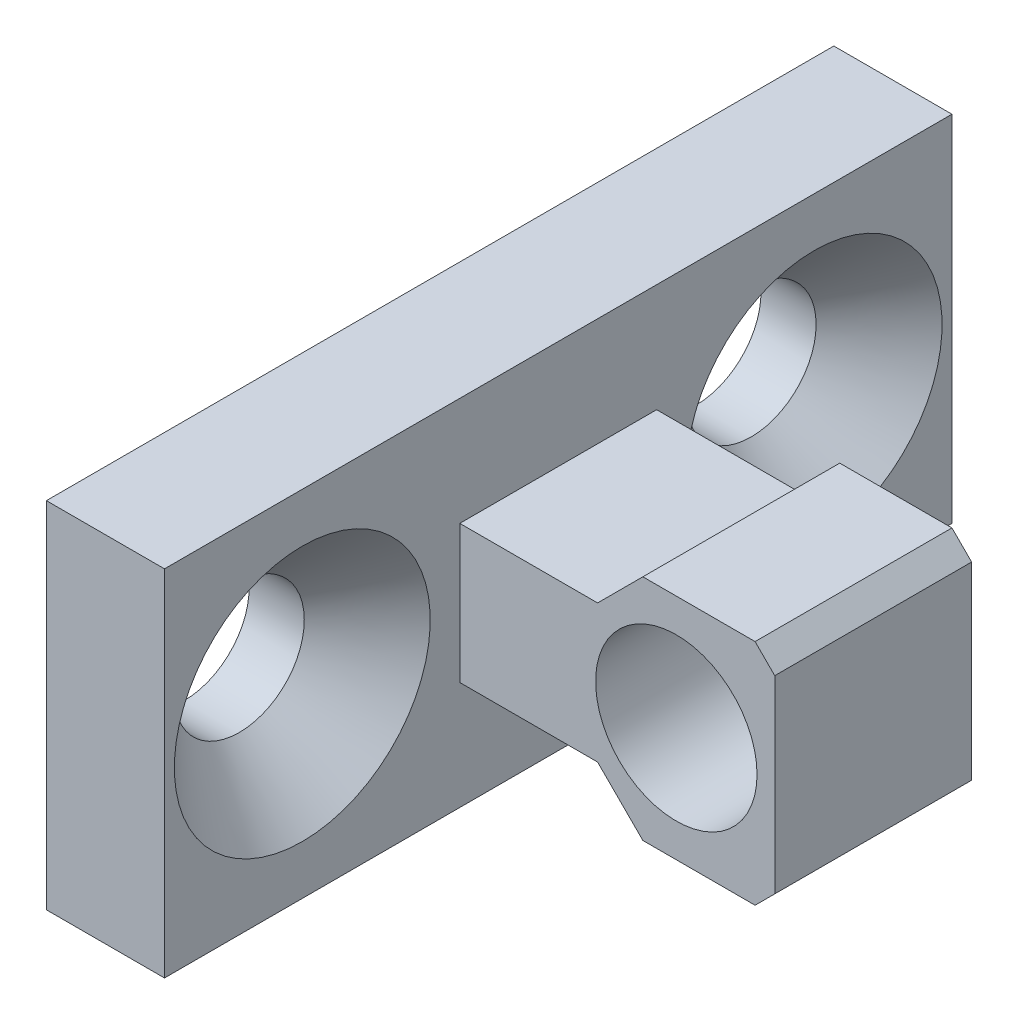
ISO-10303-21;
HEADER;
FILE_DESCRIPTION(('STEP AP214'),'2;1');
FILE_NAME('part.step','',(''),(''),'','','');
FILE_SCHEMA(('AUTOMOTIVE_DESIGN { 1 0 10303 214 1 1 1 1 }'));
ENDSEC;
DATA;
#1=APPLICATION_CONTEXT('core data for automotive mechanical design processes');
#2=APPLICATION_PROTOCOL_DEFINITION('international standard','automotive_design',2000,#1);
#3=PRODUCT_CONTEXT('',#1,'mechanical');
#4=PRODUCT('Part','Part','',(#3));
#5=PRODUCT_RELATED_PRODUCT_CATEGORY('part','',(#4));
#6=PRODUCT_DEFINITION_FORMATION('','',#4);
#7=PRODUCT_DEFINITION_CONTEXT('part definition',#1,'design');
#8=PRODUCT_DEFINITION('design','',#6,#7);
#9=PRODUCT_DEFINITION_SHAPE('','',#8);
#10=(LENGTH_UNIT() NAMED_UNIT(*) SI_UNIT(.MILLI.,.METRE.));
#11=(NAMED_UNIT(*) PLANE_ANGLE_UNIT() SI_UNIT($,.RADIAN.));
#12=(NAMED_UNIT(*) SI_UNIT($,.STERADIAN.) SOLID_ANGLE_UNIT());
#13=UNCERTAINTY_MEASURE_WITH_UNIT(LENGTH_MEASURE(1.E-05),#10,'distance_accuracy_value','');
#14=(GEOMETRIC_REPRESENTATION_CONTEXT(3) GLOBAL_UNCERTAINTY_ASSIGNED_CONTEXT((#13)) GLOBAL_UNIT_ASSIGNED_CONTEXT((#10,
#11,#12)) REPRESENTATION_CONTEXT('',''));
#15=CARTESIAN_POINT('',(0.,0.,0.));
#16=DIRECTION('',(0.,0.,1.));
#17=DIRECTION('',(1.,0.,0.));
#18=AXIS2_PLACEMENT_3D('',#15,#16,#17);
#19=CARTESIAN_POINT('',(22.,4.80000000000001,5.));
#20=DIRECTION('',(0.707106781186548,0.707106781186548,0.));
#21=DIRECTION('',(-0.707106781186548,0.707106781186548,0.));
#22=AXIS2_PLACEMENT_3D('',#19,#20,#21);
#23=PLANE('',#22);
#24=DIRECTION('',(-0.707106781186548,0.707106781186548,0.));
#25=VECTOR('',#24,1.);
#26=CARTESIAN_POINT('',(22.,4.80000000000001,5.));
#27=LINE('',#26,#25);
#28=CARTESIAN_POINT('',(21.,5.80000000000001,5.));
#29=VERTEX_POINT('',#28);
#30=CARTESIAN_POINT('',(22.,4.80000000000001,5.));
#31=VERTEX_POINT('',#30);
#32=EDGE_CURVE('E114',#29,#31,#27,.F.);
#33=ORIENTED_EDGE('',*,*,#32,.T.);
#34=DIRECTION('',(0.,0.,-1.));
#35=VECTOR('',#34,1.);
#36=CARTESIAN_POINT('',(22.,4.80000000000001,5.));
#37=LINE('',#36,#35);
#38=CARTESIAN_POINT('',(22.,4.80000000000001,-5.));
#39=VERTEX_POINT('',#38);
#40=EDGE_CURVE('E155',#39,#31,#37,.F.);
#41=ORIENTED_EDGE('',*,*,#40,.F.);
#42=DIRECTION('',(-0.707106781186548,0.707106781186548,0.));
#43=VECTOR('',#42,1.);
#44=CARTESIAN_POINT('',(22.,4.80000000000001,-5.));
#45=LINE('',#44,#43);
#46=CARTESIAN_POINT('',(21.,5.80000000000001,-5.));
#47=VERTEX_POINT('',#46);
#48=EDGE_CURVE('E165',#39,#47,#45,.T.);
#49=ORIENTED_EDGE('',*,*,#48,.T.);
#50=DIRECTION('',(0.,0.,1.));
#51=VECTOR('',#50,1.);
#52=CARTESIAN_POINT('',(21.,5.80000000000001,5.));
#53=LINE('',#52,#51);
#54=EDGE_CURVE('E158',#29,#47,#53,.F.);
#55=ORIENTED_EDGE('',*,*,#54,.F.);
#56=EDGE_LOOP('',(#33,#41,#49,#55));
#57=FACE_BOUND('',#56,.T.);
#58=ADVANCED_FACE('F15',(#57),#23,.T.);
#59=CARTESIAN_POINT('',(21.,-5.80000000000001,5.));
#60=DIRECTION('',(0.707106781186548,-0.707106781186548,0.));
#61=DIRECTION('',(0.707106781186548,0.707106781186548,0.));
#62=AXIS2_PLACEMENT_3D('',#59,#60,#61);
#63=PLANE('',#62);
#64=DIRECTION('',(0.707106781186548,0.707106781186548,0.));
#65=VECTOR('',#64,1.);
#66=CARTESIAN_POINT('',(21.,-5.80000000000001,5.));
#67=LINE('',#66,#65);
#68=CARTESIAN_POINT('',(22.,-4.80000000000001,5.));
#69=VERTEX_POINT('',#68);
#70=CARTESIAN_POINT('',(21.,-5.80000000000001,5.));
#71=VERTEX_POINT('',#70);
#72=EDGE_CURVE('E160',#69,#71,#67,.F.);
#73=ORIENTED_EDGE('',*,*,#72,.T.);
#74=DIRECTION('',(0.,0.,-1.));
#75=VECTOR('',#74,1.);
#76=CARTESIAN_POINT('',(21.,-5.80000000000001,5.));
#77=LINE('',#76,#75);
#78=CARTESIAN_POINT('',(21.,-5.80000000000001,-5.));
#79=VERTEX_POINT('',#78);
#80=EDGE_CURVE('E149',#79,#71,#77,.F.);
#81=ORIENTED_EDGE('',*,*,#80,.F.);
#82=DIRECTION('',(0.707106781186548,0.707106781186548,0.));
#83=VECTOR('',#82,1.);
#84=CARTESIAN_POINT('',(21.,-5.80000000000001,-5.));
#85=LINE('',#84,#83);
#86=CARTESIAN_POINT('',(22.,-4.80000000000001,-5.));
#87=VERTEX_POINT('',#86);
#88=EDGE_CURVE('E162',#79,#87,#85,.T.);
#89=ORIENTED_EDGE('',*,*,#88,.T.);
#90=DIRECTION('',(0.,0.,-1.));
#91=VECTOR('',#90,1.);
#92=CARTESIAN_POINT('',(22.,-4.80000000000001,5.));
#93=LINE('',#92,#91);
#94=EDGE_CURVE('E152',#69,#87,#93,.T.);
#95=ORIENTED_EDGE('',*,*,#94,.F.);
#96=EDGE_LOOP('',(#73,#81,#89,#95));
#97=FACE_BOUND('',#96,.T.);
#98=ADVANCED_FACE('F250',(#97),#63,.T.);
#99=CARTESIAN_POINT('',(21.,5.80000000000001,5.));
#100=DIRECTION('',(0.,1.,0.));
#101=DIRECTION('',(0.,0.,1.));
#102=AXIS2_PLACEMENT_3D('',#99,#100,#101);
#103=PLANE('',#102);
#104=DIRECTION('',(-1.,0.,0.));
#105=VECTOR('',#104,1.);
#106=CARTESIAN_POINT('',(14.5317939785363,5.80000000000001,5.));
#107=LINE('',#106,#105);
#108=CARTESIAN_POINT('',(15.3,5.80000000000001,5.));
#109=VERTEX_POINT('',#108);
#110=EDGE_CURVE('E124',#109,#29,#107,.F.);
#111=ORIENTED_EDGE('',*,*,#110,.T.);
#112=ORIENTED_EDGE('',*,*,#54,.T.);
#113=DIRECTION('',(-1.,0.,0.));
#114=VECTOR('',#113,1.);
#115=CARTESIAN_POINT('',(14.5317939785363,5.80000000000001,-5.));
#116=LINE('',#115,#114);
#117=CARTESIAN_POINT('',(15.3,5.80000000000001,-5.));
#118=VERTEX_POINT('',#117);
#119=EDGE_CURVE('E126',#118,#47,#116,.F.);
#120=ORIENTED_EDGE('',*,*,#119,.F.);
#121=DIRECTION('',(0.,0.,1.));
#122=VECTOR('',#121,1.);
#123=CARTESIAN_POINT('',(15.3,5.80000000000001,5.));
#124=LINE('',#123,#122);
#125=EDGE_CURVE('E120',#109,#118,#124,.F.);
#126=ORIENTED_EDGE('',*,*,#125,.F.);
#127=EDGE_LOOP('',(#111,#112,#120,#126));
#128=FACE_BOUND('',#127,.T.);
#129=ADVANCED_FACE('F122',(#128),#103,.T.);
#130=CARTESIAN_POINT('',(22.,-4.80000000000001,5.));
#131=DIRECTION('',(1.,0.,0.));
#132=DIRECTION('',(0.,0.,-1.));
#133=AXIS2_PLACEMENT_3D('',#130,#131,#132);
#134=PLANE('',#133);
#135=DIRECTION('',(0.,1.,0.));
#136=VECTOR('',#135,1.);
#137=CARTESIAN_POINT('',(22.,0.,5.));
#138=LINE('',#137,#136);
#139=EDGE_CURVE('E140',#31,#69,#138,.F.);
#140=ORIENTED_EDGE('',*,*,#139,.T.);
#141=ORIENTED_EDGE('',*,*,#94,.T.);
#142=DIRECTION('',(0.,1.,0.));
#143=VECTOR('',#142,1.);
#144=CARTESIAN_POINT('',(22.,0.,-5.));
#145=LINE('',#144,#143);
#146=EDGE_CURVE('E193',#39,#87,#145,.F.);
#147=ORIENTED_EDGE('',*,*,#146,.F.);
#148=ORIENTED_EDGE('',*,*,#40,.T.);
#149=EDGE_LOOP('',(#140,#141,#147,#148));
#150=FACE_BOUND('',#149,.T.);
#151=ADVANCED_FACE('F247',(#150),#134,.T.);
#152=CARTESIAN_POINT('',(15.3,-5.80000000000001,5.));
#153=DIRECTION('',(0.,-1.,0.));
#154=DIRECTION('',(0.,0.,-1.));
#155=AXIS2_PLACEMENT_3D('',#152,#153,#154);
#156=PLANE('',#155);
#157=DIRECTION('',(-1.,0.,0.));
#158=VECTOR('',#157,1.);
#159=CARTESIAN_POINT('',(14.5317939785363,-5.80000000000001,5.));
#160=LINE('',#159,#158);
#161=CARTESIAN_POINT('',(15.3,-5.80000000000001,5.));
#162=VERTEX_POINT('',#161);
#163=EDGE_CURVE('E143',#71,#162,#160,.T.);
#164=ORIENTED_EDGE('',*,*,#163,.T.);
#165=DIRECTION('',(0.,0.,1.));
#166=VECTOR('',#165,1.);
#167=CARTESIAN_POINT('',(15.3,-5.8,5.));
#168=LINE('',#167,#166);
#169=CARTESIAN_POINT('',(15.3,-5.80000000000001,-5.));
#170=VERTEX_POINT('',#169);
#171=EDGE_CURVE('E130',#170,#162,#168,.T.);
#172=ORIENTED_EDGE('',*,*,#171,.F.);
#173=DIRECTION('',(-1.,0.,0.));
#174=VECTOR('',#173,1.);
#175=CARTESIAN_POINT('',(14.5317939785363,-5.80000000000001,-5.));
#176=LINE('',#175,#174);
#177=EDGE_CURVE('E187',#79,#170,#176,.T.);
#178=ORIENTED_EDGE('',*,*,#177,.F.);
#179=ORIENTED_EDGE('',*,*,#80,.T.);
#180=EDGE_LOOP('',(#164,#172,#178,#179));
#181=FACE_BOUND('',#180,.T.);
#182=ADVANCED_FACE('F213',(#181),#156,.T.);
#183=CARTESIAN_POINT('',(13.,-3.5,5.));
#184=DIRECTION('',(-0.707106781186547,-0.707106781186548,0.));
#185=DIRECTION('',(0.707106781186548,-0.707106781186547,0.));
#186=AXIS2_PLACEMENT_3D('',#183,#184,#185);
#187=PLANE('',#186);
#188=DIRECTION('',(-0.707106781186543,0.707106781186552,0.));
#189=VECTOR('',#188,1.);
#190=CARTESIAN_POINT('',(15.3,-5.80000000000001,5.));
#191=LINE('',#190,#189);
#192=CARTESIAN_POINT('',(13.,-3.5,5.));
#193=VERTEX_POINT('',#192);
#194=EDGE_CURVE('E210',#162,#193,#191,.T.);
#195=ORIENTED_EDGE('',*,*,#194,.T.);
#196=DIRECTION('',(0.,0.,-1.));
#197=VECTOR('',#196,1.);
#198=CARTESIAN_POINT('',(13.,-3.5,5.));
#199=LINE('',#198,#197);
#200=CARTESIAN_POINT('',(13.,-3.5,-5.));
#201=VERTEX_POINT('',#200);
#202=EDGE_CURVE('E207',#201,#193,#199,.F.);
#203=ORIENTED_EDGE('',*,*,#202,.F.);
#204=DIRECTION('',(-0.707106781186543,0.707106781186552,0.));
#205=VECTOR('',#204,1.);
#206=CARTESIAN_POINT('',(15.3,-5.80000000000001,-5.));
#207=LINE('',#206,#205);
#208=EDGE_CURVE('E180',#170,#201,#207,.T.);
#209=ORIENTED_EDGE('',*,*,#208,.F.);
#210=ORIENTED_EDGE('',*,*,#171,.T.);
#211=EDGE_LOOP('',(#195,#203,#209,#210));
#212=FACE_BOUND('',#211,.T.);
#213=ADVANCED_FACE('F218',(#212),#187,.T.);
#214=CARTESIAN_POINT('',(17.,0.,0.));
#215=DIRECTION('',(0.,0.,1.));
#216=DIRECTION('',(1.,0.,0.));
#217=AXIS2_PLACEMENT_3D('',#214,#215,#216);
#218=CYLINDRICAL_SURFACE('',#217,4.1);
#219=CARTESIAN_POINT('',(17.,0.,5.));
#220=DIRECTION('',(0.,0.,1.));
#221=DIRECTION('',(1.,0.,0.));
#222=AXIS2_PLACEMENT_3D('',#219,#220,#221);
#223=CIRCLE('',#222,4.1);
#224=CARTESIAN_POINT('',(21.1,0.,5.));
#225=VERTEX_POINT('',#224);
#226=EDGE_CURVE('E18',#225,#225,#223,.T.);
#227=ORIENTED_EDGE('',*,*,#226,.T.);
#228=EDGE_LOOP('',(#227));
#229=FACE_BOUND('',#228,.T.);
#230=CARTESIAN_POINT('',(17.,0.,-5.));
#231=DIRECTION('',(0.,0.,1.));
#232=DIRECTION('',(1.,0.,0.));
#233=AXIS2_PLACEMENT_3D('',#230,#231,#232);
#234=CIRCLE('',#233,4.1);
#235=CARTESIAN_POINT('',(21.1,0.,-5.));
#236=VERTEX_POINT('',#235);
#237=EDGE_CURVE('E177',#236,#236,#234,.T.);
#238=ORIENTED_EDGE('',*,*,#237,.F.);
#239=EDGE_LOOP('',(#238));
#240=FACE_BOUND('',#239,.T.);
#241=ADVANCED_FACE('F311',(#229,#240),#218,.F.);
#242=CARTESIAN_POINT('',(15.3,5.80000000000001,5.));
#243=DIRECTION('',(-0.707106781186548,0.707106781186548,0.));
#244=DIRECTION('',(-0.707106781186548,-0.707106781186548,0.));
#245=AXIS2_PLACEMENT_3D('',#242,#243,#244);
#246=PLANE('',#245);
#247=DIRECTION('',(0.707106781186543,0.707106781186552,0.));
#248=VECTOR('',#247,1.);
#249=CARTESIAN_POINT('',(13.,3.5,5.));
#250=LINE('',#249,#248);
#251=CARTESIAN_POINT('',(13.,3.5,5.));
#252=VERTEX_POINT('',#251);
#253=EDGE_CURVE('E129',#252,#109,#250,.T.);
#254=ORIENTED_EDGE('',*,*,#253,.T.);
#255=ORIENTED_EDGE('',*,*,#125,.T.);
#256=DIRECTION('',(0.707106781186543,0.707106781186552,0.));
#257=VECTOR('',#256,1.);
#258=CARTESIAN_POINT('',(13.,3.5,-5.));
#259=LINE('',#258,#257);
#260=CARTESIAN_POINT('',(13.,3.5,-5.));
#261=VERTEX_POINT('',#260);
#262=EDGE_CURVE('E200',#261,#118,#259,.T.);
#263=ORIENTED_EDGE('',*,*,#262,.F.);
#264=DIRECTION('',(0.,0.,1.));
#265=VECTOR('',#264,1.);
#266=CARTESIAN_POINT('',(13.,3.5,5.));
#267=LINE('',#266,#265);
#268=EDGE_CURVE('E135',#252,#261,#267,.F.);
#269=ORIENTED_EDGE('',*,*,#268,.F.);
#270=EDGE_LOOP('',(#254,#255,#263,#269));
#271=FACE_BOUND('',#270,.T.);
#272=ADVANCED_FACE('F133',(#271),#246,.T.);
#273=CARTESIAN_POINT('',(14.5317939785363,0.,5.));
#274=DIRECTION('',(0.,0.,-1.));
#275=DIRECTION('',(-1.,0.,0.));
#276=AXIS2_PLACEMENT_3D('',#273,#274,#275);
#277=PLANE('',#276);
#278=ORIENTED_EDGE('',*,*,#226,.F.);
#279=EDGE_LOOP('',(#278));
#280=FACE_BOUND('',#279,.T.);
#281=DIRECTION('',(1.,0.,0.));
#282=VECTOR('',#281,1.);
#283=CARTESIAN_POINT('',(6.,-3.5,5.));
#284=LINE('',#283,#282);
#285=CARTESIAN_POINT('',(6.,-3.5,5.));
#286=VERTEX_POINT('',#285);
#287=EDGE_CURVE('E204',#193,#286,#284,.F.);
#288=ORIENTED_EDGE('',*,*,#287,.F.);
#289=ORIENTED_EDGE('',*,*,#194,.F.);
#290=ORIENTED_EDGE('',*,*,#163,.F.);
#291=ORIENTED_EDGE('',*,*,#72,.F.);
#292=ORIENTED_EDGE('',*,*,#139,.F.);
#293=ORIENTED_EDGE('',*,*,#32,.F.);
#294=ORIENTED_EDGE('',*,*,#110,.F.);
#295=ORIENTED_EDGE('',*,*,#253,.F.);
#296=DIRECTION('',(1.,0.,0.));
#297=VECTOR('',#296,1.);
#298=CARTESIAN_POINT('',(13.,3.5,5.));
#299=LINE('',#298,#297);
#300=CARTESIAN_POINT('',(6.,3.5,5.));
#301=VERTEX_POINT('',#300);
#302=EDGE_CURVE('E184',#301,#252,#299,.T.);
#303=ORIENTED_EDGE('',*,*,#302,.F.);
#304=DIRECTION('',(0.,1.,0.));
#305=VECTOR('',#304,1.);
#306=CARTESIAN_POINT('',(6.,0.,5.));
#307=LINE('',#306,#305);
#308=EDGE_CURVE('E220',#301,#286,#307,.F.);
#309=ORIENTED_EDGE('',*,*,#308,.T.);
#310=EDGE_LOOP('',(#288,#289,#290,#291,#292,#293,#294,#295,#303,#309));
#311=FACE_BOUND('',#310,.T.);
#312=ADVANCED_FACE('F139',(#280,#311),#277,.F.);
#313=CARTESIAN_POINT('',(6.,-3.5,5.));
#314=DIRECTION('',(0.,-1.,0.));
#315=DIRECTION('',(0.,0.,-1.));
#316=AXIS2_PLACEMENT_3D('',#313,#314,#315);
#317=PLANE('',#316);
#318=ORIENTED_EDGE('',*,*,#287,.T.);
#319=DIRECTION('',(0.,0.,1.));
#320=VECTOR('',#319,1.);
#321=CARTESIAN_POINT('',(6.,-3.5,0.));
#322=LINE('',#321,#320);
#323=CARTESIAN_POINT('',(6.,-3.5,-5.));
#324=VERTEX_POINT('',#323);
#325=EDGE_CURVE('E225',#286,#324,#322,.F.);
#326=ORIENTED_EDGE('',*,*,#325,.T.);
#327=DIRECTION('',(-1.,0.,0.));
#328=VECTOR('',#327,1.);
#329=CARTESIAN_POINT('',(14.5317939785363,-3.5,-5.));
#330=LINE('',#329,#328);
#331=EDGE_CURVE('E202',#201,#324,#330,.T.);
#332=ORIENTED_EDGE('',*,*,#331,.F.);
#333=ORIENTED_EDGE('',*,*,#202,.T.);
#334=EDGE_LOOP('',(#318,#326,#332,#333));
#335=FACE_BOUND('',#334,.T.);
#336=ADVANCED_FACE('F224',(#335),#317,.T.);
#337=CARTESIAN_POINT('',(14.5317939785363,0.,-5.));
#338=DIRECTION('',(0.,0.,-1.));
#339=DIRECTION('',(-1.,0.,0.));
#340=AXIS2_PLACEMENT_3D('',#337,#338,#339);
#341=PLANE('',#340);
#342=ORIENTED_EDGE('',*,*,#237,.T.);
#343=EDGE_LOOP('',(#342));
#344=FACE_BOUND('',#343,.T.);
#345=ORIENTED_EDGE('',*,*,#177,.T.);
#346=ORIENTED_EDGE('',*,*,#208,.T.);
#347=ORIENTED_EDGE('',*,*,#331,.T.);
#348=DIRECTION('',(0.,1.,0.));
#349=VECTOR('',#348,1.);
#350=CARTESIAN_POINT('',(6.,0.,-5.));
#351=LINE('',#350,#349);
#352=CARTESIAN_POINT('',(6.,3.5,-5.));
#353=VERTEX_POINT('',#352);
#354=EDGE_CURVE('E229',#324,#353,#351,.T.);
#355=ORIENTED_EDGE('',*,*,#354,.T.);
#356=DIRECTION('',(1.,0.,0.));
#357=VECTOR('',#356,1.);
#358=CARTESIAN_POINT('',(13.,3.5,-5.));
#359=LINE('',#358,#357);
#360=EDGE_CURVE('E179',#261,#353,#359,.F.);
#361=ORIENTED_EDGE('',*,*,#360,.F.);
#362=ORIENTED_EDGE('',*,*,#262,.T.);
#363=ORIENTED_EDGE('',*,*,#119,.T.);
#364=ORIENTED_EDGE('',*,*,#48,.F.);
#365=ORIENTED_EDGE('',*,*,#146,.T.);
#366=ORIENTED_EDGE('',*,*,#88,.F.);
#367=EDGE_LOOP('',(#345,#346,#347,#355,#361,#362,#363,#364,#365,#366));
#368=FACE_BOUND('',#367,.T.);
#369=ADVANCED_FACE('F227',(#344,#368),#341,.T.);
#370=CARTESIAN_POINT('',(13.,3.5,5.));
#371=DIRECTION('',(0.,1.,0.));
#372=DIRECTION('',(0.,0.,1.));
#373=AXIS2_PLACEMENT_3D('',#370,#371,#372);
#374=PLANE('',#373);
#375=ORIENTED_EDGE('',*,*,#302,.T.);
#376=ORIENTED_EDGE('',*,*,#268,.T.);
#377=ORIENTED_EDGE('',*,*,#360,.T.);
#378=DIRECTION('',(0.,0.,1.));
#379=VECTOR('',#378,1.);
#380=CARTESIAN_POINT('',(6.,3.5,0.));
#381=LINE('',#380,#379);
#382=EDGE_CURVE('E176',#353,#301,#381,.T.);
#383=ORIENTED_EDGE('',*,*,#382,.T.);
#384=EDGE_LOOP('',(#375,#376,#377,#383));
#385=FACE_BOUND('',#384,.T.);
#386=ADVANCED_FACE('F242',(#385),#374,.T.);
#387=CARTESIAN_POINT('',(6.,0.,0.));
#388=DIRECTION('',(-1.,0.,0.));
#389=DIRECTION('',(0.,0.,1.));
#390=AXIS2_PLACEMENT_3D('',#387,#388,#389);
#391=PLANE('',#390);
#392=CARTESIAN_POINT('',(6.00000000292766,0.,13.));
#393=DIRECTION('',(1.,0.,0.));
#394=DIRECTION('',(0.,1.,0.));
#395=AXIS2_PLACEMENT_3D('',#392,#393,#394);
#396=CIRCLE('',#395,6.49999999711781);
#397=CARTESIAN_POINT('',(6.00000000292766,6.49999999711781,13.));
#398=VERTEX_POINT('',#397);
#399=EDGE_CURVE('E170',#398,#398,#396,.F.);
#400=ORIENTED_EDGE('',*,*,#399,.T.);
#401=EDGE_LOOP('',(#400));
#402=FACE_BOUND('',#401,.T.);
#403=CARTESIAN_POINT('',(6.00000000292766,0.,-13.));
#404=DIRECTION('',(1.,0.,0.));
#405=DIRECTION('',(0.,1.,0.));
#406=AXIS2_PLACEMENT_3D('',#403,#404,#405);
#407=CIRCLE('',#406,6.49999999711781);
#408=CARTESIAN_POINT('',(6.00000000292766,6.49999999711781,-13.));
#409=VERTEX_POINT('',#408);
#410=EDGE_CURVE('E174',#409,#409,#407,.F.);
#411=ORIENTED_EDGE('',*,*,#410,.T.);
#412=EDGE_LOOP('',(#411));
#413=FACE_BOUND('',#412,.T.);
#414=ORIENTED_EDGE('',*,*,#354,.F.);
#415=ORIENTED_EDGE('',*,*,#325,.F.);
#416=ORIENTED_EDGE('',*,*,#308,.F.);
#417=ORIENTED_EDGE('',*,*,#382,.F.);
#418=EDGE_LOOP('',(#414,#415,#416,#417));
#419=FACE_BOUND('',#418,.T.);
#420=DIRECTION('',(0.,1.,0.));
#421=VECTOR('',#420,1.);
#422=CARTESIAN_POINT('',(6.,0.,20.));
#423=LINE('',#422,#421);
#424=CARTESIAN_POINT('',(6.,9.,20.));
#425=VERTEX_POINT('',#424);
#426=CARTESIAN_POINT('',(6.,-9.,20.));
#427=VERTEX_POINT('',#426);
#428=EDGE_CURVE('E425',#425,#427,#423,.F.);
#429=ORIENTED_EDGE('',*,*,#428,.T.);
#430=DIRECTION('',(0.,0.,1.));
#431=VECTOR('',#430,1.);
#432=CARTESIAN_POINT('',(6.,-9.,0.));
#433=LINE('',#432,#431);
#434=CARTESIAN_POINT('',(6.,-9.,-20.));
#435=VERTEX_POINT('',#434);
#436=EDGE_CURVE('E438',#427,#435,#433,.F.);
#437=ORIENTED_EDGE('',*,*,#436,.T.);
#438=DIRECTION('',(0.,1.,0.));
#439=VECTOR('',#438,1.);
#440=CARTESIAN_POINT('',(6.,0.,-20.));
#441=LINE('',#440,#439);
#442=CARTESIAN_POINT('',(6.,9.,-20.));
#443=VERTEX_POINT('',#442);
#444=EDGE_CURVE('E442',#435,#443,#441,.T.);
#445=ORIENTED_EDGE('',*,*,#444,.T.);
#446=DIRECTION('',(0.,0.,-1.));
#447=VECTOR('',#446,1.);
#448=CARTESIAN_POINT('',(6.,9.,0.));
#449=LINE('',#448,#447);
#450=EDGE_CURVE('E173',#443,#425,#449,.F.);
#451=ORIENTED_EDGE('',*,*,#450,.T.);
#452=EDGE_LOOP('',(#429,#437,#445,#451));
#453=FACE_BOUND('',#452,.T.);
#454=ADVANCED_FACE('F232',(#402,#413,#419,#453),#391,.F.);
#455=CARTESIAN_POINT('',(6.00000000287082,0.,-13.));
#456=DIRECTION('',(1.,0.,0.));
#457=DIRECTION('',(0.,1.,0.));
#458=AXIS2_PLACEMENT_3D('',#455,#456,#457);
#459=CONICAL_SURFACE('',#458,6.49999999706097,0.785398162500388);
#460=ORIENTED_EDGE('',*,*,#410,.F.);
#461=EDGE_LOOP('',(#460));
#462=FACE_BOUND('',#461,.T.);
#463=CARTESIAN_POINT('',(2.79999999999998,0.,-13.));
#464=DIRECTION('',(-1.,0.,0.));
#465=DIRECTION('',(0.,-1.,0.));
#466=AXIS2_PLACEMENT_3D('',#463,#464,#465);
#467=CIRCLE('',#466,3.3);
#468=CARTESIAN_POINT('',(2.79999999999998,-3.3,-13.));
#469=VERTEX_POINT('',#468);
#470=EDGE_CURVE('E418',#469,#469,#467,.T.);
#471=ORIENTED_EDGE('',*,*,#470,.T.);
#472=EDGE_LOOP('',(#471));
#473=FACE_BOUND('',#472,.T.);
#474=ADVANCED_FACE('F292',(#462,#473),#459,.F.);
#475=CARTESIAN_POINT('',(6.00000000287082,0.,13.));
#476=DIRECTION('',(1.,0.,0.));
#477=DIRECTION('',(0.,1.,0.));
#478=AXIS2_PLACEMENT_3D('',#475,#476,#477);
#479=CONICAL_SURFACE('',#478,6.49999999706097,0.785398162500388);
#480=ORIENTED_EDGE('',*,*,#399,.F.);
#481=EDGE_LOOP('',(#480));
#482=FACE_BOUND('',#481,.T.);
#483=CARTESIAN_POINT('',(2.79999999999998,0.,13.));
#484=DIRECTION('',(-1.,0.,0.));
#485=DIRECTION('',(0.,-1.,0.));
#486=AXIS2_PLACEMENT_3D('',#483,#484,#485);
#487=CIRCLE('',#486,3.3);
#488=CARTESIAN_POINT('',(2.79999999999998,-3.3,13.));
#489=VERTEX_POINT('',#488);
#490=EDGE_CURVE('E420',#489,#489,#487,.T.);
#491=ORIENTED_EDGE('',*,*,#490,.T.);
#492=EDGE_LOOP('',(#491));
#493=FACE_BOUND('',#492,.T.);
#494=ADVANCED_FACE('F288',(#482,#493),#479,.F.);
#495=CARTESIAN_POINT('',(3.,9.,0.));
#496=DIRECTION('',(0.,-1.,0.));
#497=DIRECTION('',(0.,0.,-1.));
#498=AXIS2_PLACEMENT_3D('',#495,#496,#497);
#499=PLANE('',#498);
#500=ORIENTED_EDGE('',*,*,#450,.F.);
#501=DIRECTION('',(1.,0.,0.));
#502=VECTOR('',#501,1.);
#503=CARTESIAN_POINT('',(3.,9.,-20.));
#504=LINE('',#503,#502);
#505=CARTESIAN_POINT('',(0.,9.,-20.));
#506=VERTEX_POINT('',#505);
#507=EDGE_CURVE('E440',#443,#506,#504,.F.);
#508=ORIENTED_EDGE('',*,*,#507,.T.);
#509=DIRECTION('',(0.,0.,1.));
#510=VECTOR('',#509,1.);
#511=CARTESIAN_POINT('',(0.,9.,0.));
#512=LINE('',#511,#510);
#513=CARTESIAN_POINT('',(0.,9.,20.));
#514=VERTEX_POINT('',#513);
#515=EDGE_CURVE('E423',#514,#506,#512,.F.);
#516=ORIENTED_EDGE('',*,*,#515,.F.);
#517=DIRECTION('',(-1.,0.,0.));
#518=VECTOR('',#517,1.);
#519=CARTESIAN_POINT('',(3.,9.,20.));
#520=LINE('',#519,#518);
#521=EDGE_CURVE('E433',#514,#425,#520,.F.);
#522=ORIENTED_EDGE('',*,*,#521,.T.);
#523=EDGE_LOOP('',(#500,#508,#516,#522));
#524=FACE_BOUND('',#523,.T.);
#525=ADVANCED_FACE('F284',(#524),#499,.F.);
#526=CARTESIAN_POINT('',(3.,0.,-20.));
#527=DIRECTION('',(0.,0.,1.));
#528=DIRECTION('',(1.,0.,0.));
#529=AXIS2_PLACEMENT_3D('',#526,#527,#528);
#530=PLANE('',#529);
#531=ORIENTED_EDGE('',*,*,#444,.F.);
#532=DIRECTION('',(1.,0.,0.));
#533=VECTOR('',#532,1.);
#534=CARTESIAN_POINT('',(3.,-9.,-20.));
#535=LINE('',#534,#533);
#536=CARTESIAN_POINT('',(0.,-9.,-20.));
#537=VERTEX_POINT('',#536);
#538=EDGE_CURVE('E436',#435,#537,#535,.F.);
#539=ORIENTED_EDGE('',*,*,#538,.T.);
#540=DIRECTION('',(0.,1.,0.));
#541=VECTOR('',#540,1.);
#542=CARTESIAN_POINT('',(0.,0.,-20.));
#543=LINE('',#542,#541);
#544=EDGE_CURVE('E456',#506,#537,#543,.F.);
#545=ORIENTED_EDGE('',*,*,#544,.F.);
#546=ORIENTED_EDGE('',*,*,#507,.F.);
#547=EDGE_LOOP('',(#531,#539,#545,#546));
#548=FACE_BOUND('',#547,.T.);
#549=ADVANCED_FACE('F281',(#548),#530,.F.);
#550=CARTESIAN_POINT('',(3.,-9.,0.));
#551=DIRECTION('',(0.,1.,0.));
#552=DIRECTION('',(0.,0.,1.));
#553=AXIS2_PLACEMENT_3D('',#550,#551,#552);
#554=PLANE('',#553);
#555=ORIENTED_EDGE('',*,*,#436,.F.);
#556=DIRECTION('',(-1.,0.,0.));
#557=VECTOR('',#556,1.);
#558=CARTESIAN_POINT('',(3.,-9.,20.));
#559=LINE('',#558,#557);
#560=CARTESIAN_POINT('',(0.,-9.,20.));
#561=VERTEX_POINT('',#560);
#562=EDGE_CURVE('E33',#427,#561,#559,.T.);
#563=ORIENTED_EDGE('',*,*,#562,.T.);
#564=DIRECTION('',(0.,0.,1.));
#565=VECTOR('',#564,1.);
#566=CARTESIAN_POINT('',(0.,-9.,0.));
#567=LINE('',#566,#565);
#568=EDGE_CURVE('E452',#537,#561,#567,.T.);
#569=ORIENTED_EDGE('',*,*,#568,.F.);
#570=ORIENTED_EDGE('',*,*,#538,.F.);
#571=EDGE_LOOP('',(#555,#563,#569,#570));
#572=FACE_BOUND('',#571,.T.);
#573=ADVANCED_FACE('F277',(#572),#554,.F.);
#574=CARTESIAN_POINT('',(3.,0.,20.));
#575=DIRECTION('',(0.,0.,-1.));
#576=DIRECTION('',(-1.,0.,0.));
#577=AXIS2_PLACEMENT_3D('',#574,#575,#576);
#578=PLANE('',#577);
#579=ORIENTED_EDGE('',*,*,#428,.F.);
#580=ORIENTED_EDGE('',*,*,#521,.F.);
#581=DIRECTION('',(0.,1.,0.));
#582=VECTOR('',#581,1.);
#583=CARTESIAN_POINT('',(0.,0.,20.));
#584=LINE('',#583,#582);
#585=EDGE_CURVE('E169',#561,#514,#584,.T.);
#586=ORIENTED_EDGE('',*,*,#585,.F.);
#587=ORIENTED_EDGE('',*,*,#562,.F.);
#588=EDGE_LOOP('',(#579,#580,#586,#587));
#589=FACE_BOUND('',#588,.T.);
#590=ADVANCED_FACE('F273',(#589),#578,.F.);
#591=CARTESIAN_POINT('',(3.,0.,-13.));
#592=DIRECTION('',(-1.,0.,0.));
#593=DIRECTION('',(0.,-1.,0.));
#594=AXIS2_PLACEMENT_3D('',#591,#592,#593);
#595=CYLINDRICAL_SURFACE('',#594,3.3);
#596=CARTESIAN_POINT('',(0.,0.,-13.));
#597=DIRECTION('',(-1.,0.,0.));
#598=DIRECTION('',(0.,-1.,0.));
#599=AXIS2_PLACEMENT_3D('',#596,#597,#598);
#600=CIRCLE('',#599,3.3);
#601=CARTESIAN_POINT('',(0.,-3.3,-13.));
#602=VERTEX_POINT('',#601);
#603=EDGE_CURVE('E24',#602,#602,#600,.F.);
#604=ORIENTED_EDGE('',*,*,#603,.F.);
#605=EDGE_LOOP('',(#604));
#606=FACE_BOUND('',#605,.T.);
#607=ORIENTED_EDGE('',*,*,#470,.F.);
#608=EDGE_LOOP('',(#607));
#609=FACE_BOUND('',#608,.T.);
#610=ADVANCED_FACE('F266',(#606,#609),#595,.F.);
#611=CARTESIAN_POINT('',(3.,0.,13.));
#612=DIRECTION('',(-1.,0.,0.));
#613=DIRECTION('',(0.,-1.,0.));
#614=AXIS2_PLACEMENT_3D('',#611,#612,#613);
#615=CYLINDRICAL_SURFACE('',#614,3.3);
#616=CARTESIAN_POINT('',(0.,0.,13.));
#617=DIRECTION('',(-1.,0.,0.));
#618=DIRECTION('',(0.,-1.,0.));
#619=AXIS2_PLACEMENT_3D('',#616,#617,#618);
#620=CIRCLE('',#619,3.3);
#621=CARTESIAN_POINT('',(0.,-3.3,13.));
#622=VERTEX_POINT('',#621);
#623=EDGE_CURVE('E10',#622,#622,#620,.F.);
#624=ORIENTED_EDGE('',*,*,#623,.F.);
#625=EDGE_LOOP('',(#624));
#626=FACE_BOUND('',#625,.T.);
#627=ORIENTED_EDGE('',*,*,#490,.F.);
#628=EDGE_LOOP('',(#627));
#629=FACE_BOUND('',#628,.T.);
#630=ADVANCED_FACE('F260',(#626,#629),#615,.F.);
#631=CARTESIAN_POINT('',(0.,0.,0.));
#632=DIRECTION('',(-1.,0.,0.));
#633=DIRECTION('',(0.,0.,1.));
#634=AXIS2_PLACEMENT_3D('',#631,#632,#633);
#635=PLANE('',#634);
#636=ORIENTED_EDGE('',*,*,#623,.T.);
#637=EDGE_LOOP('',(#636));
#638=FACE_BOUND('',#637,.T.);
#639=ORIENTED_EDGE('',*,*,#603,.T.);
#640=EDGE_LOOP('',(#639));
#641=FACE_BOUND('',#640,.T.);
#642=ORIENTED_EDGE('',*,*,#568,.T.);
#643=ORIENTED_EDGE('',*,*,#585,.T.);
#644=ORIENTED_EDGE('',*,*,#515,.T.);
#645=ORIENTED_EDGE('',*,*,#544,.T.);
#646=EDGE_LOOP('',(#642,#643,#644,#645));
#647=FACE_BOUND('',#646,.T.);
#648=ADVANCED_FACE('F258',(#638,#641,#647),#635,.T.);
#649=CLOSED_SHELL('',(#58,#98,#129,#151,#182,#213,#241,#272,#312,#336,#369,#386,#454,#474,#494,
#525,#549,#573,#590,#610,#630,#648));
#650=MANIFOLD_SOLID_BREP('B1',#649);
#651=ADVANCED_BREP_SHAPE_REPRESENTATION('',(#18,#650),#14);
#652=SHAPE_DEFINITION_REPRESENTATION(#9,#651);
ENDSEC;
END-ISO-10303-21;
